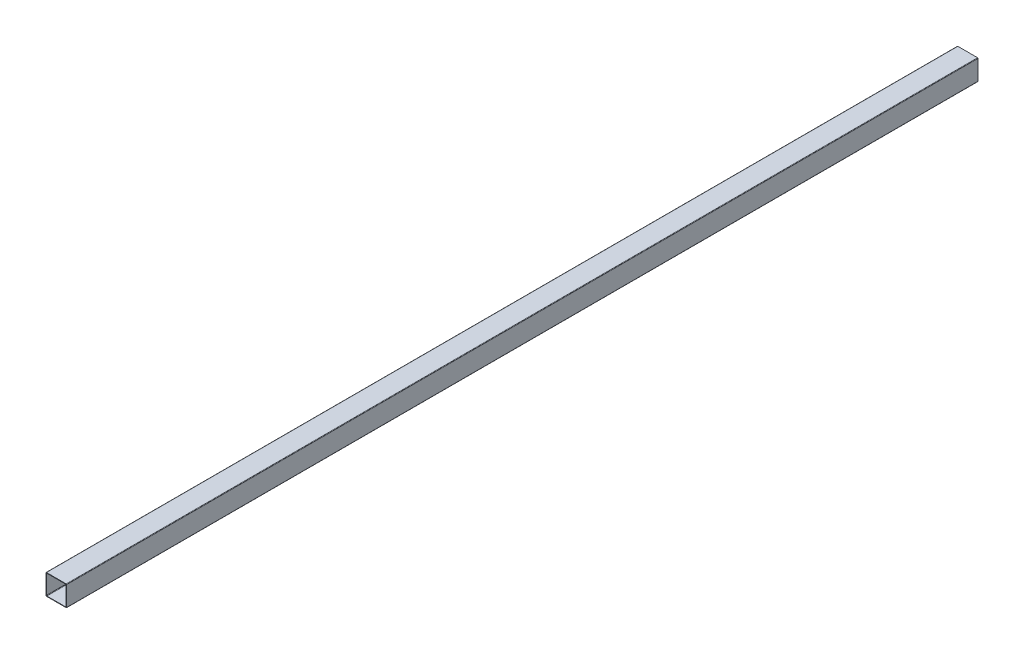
from build123d import *

# Parameters (mm, degrees)
BOSS_EXTRU_1_DEPTH = 3975


with BuildPart() as part:
    # Esquisse1 → Boss.-Extru.1 (new body)
    with BuildSketch(Plane.XY):
        with BuildLine():
            Line((43, -45), (-43, -45))
            ThreePointArc((-43, -45), (-44.414213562, -44.414213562), (-45, -43))
            Line((-45, -43), (-45, 43))
            ThreePointArc((-45, 43), (-44.414213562, 44.414213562), (-43, 45))
            Line((-43, 45), (43, 45))
            ThreePointArc((43, 45), (44.414213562, 44.414213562), (45, 43))
            Line((45, 43), (45, -43))
            ThreePointArc((45, -43), (44.414213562, -44.414213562), (43, -45))
        make_face()
        with BuildLine():
            Line((41, -43), (-41, -43))
            ThreePointArc((-41, -43), (-42.414213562, -42.414213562), (-43, -41))
            Line((-43, -41), (-43, 41))
            ThreePointArc((-43, 41), (-42.414213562, 42.414213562), (-41, 43))
            Line((-41, 43), (41, 43))
            ThreePointArc((41, 43), (42.414213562, 42.414213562), (43, 41))
            Line((43, 41), (43, -41))
            ThreePointArc((43, -41), (42.414213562, -42.414213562), (41, -43))
        make_face(mode=Mode.SUBTRACT)
    extrude(amount=BOSS_EXTRU_1_DEPTH)


solid = part.part
